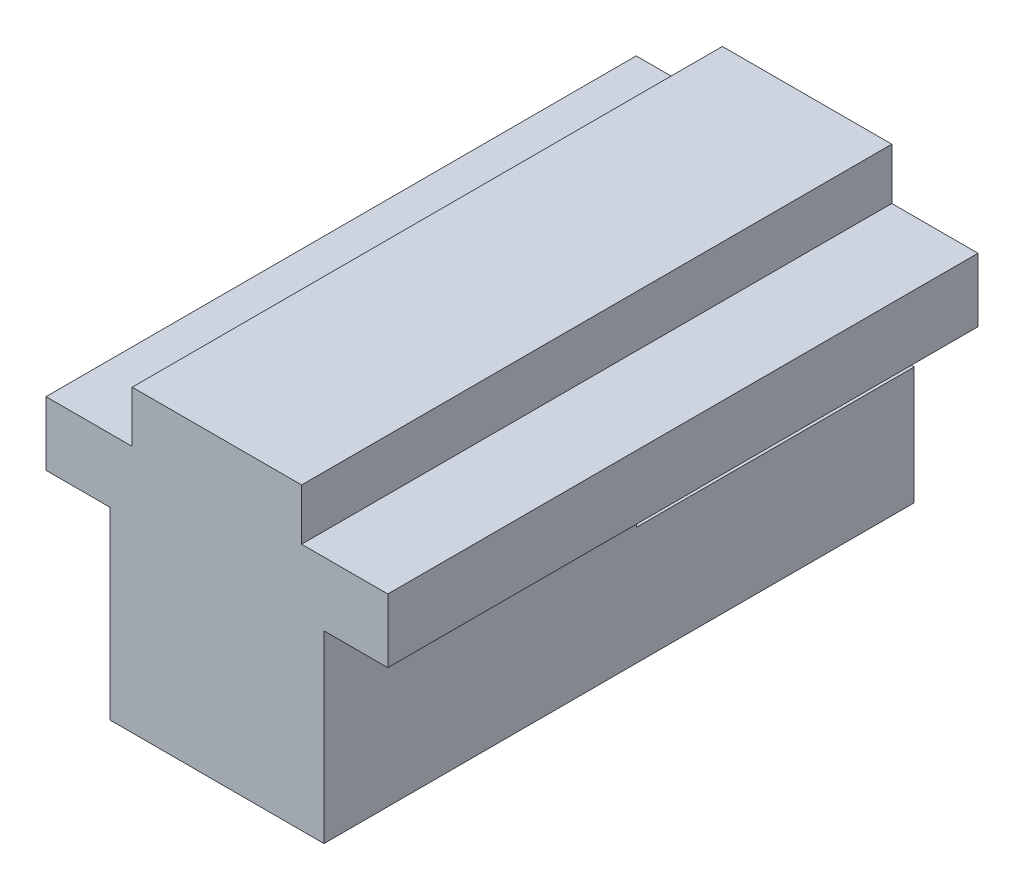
ISO-10303-21;
HEADER;
FILE_DESCRIPTION(('STEP AP214'),'2;1');
FILE_NAME('part.step','',(''),(''),'','','');
FILE_SCHEMA(('AUTOMOTIVE_DESIGN { 1 0 10303 214 1 1 1 1 }'));
ENDSEC;
DATA;
#1=APPLICATION_CONTEXT('core data for automotive mechanical design processes');
#2=APPLICATION_PROTOCOL_DEFINITION('international standard','automotive_design',2000,#1);
#3=PRODUCT_CONTEXT('',#1,'mechanical');
#4=PRODUCT('Part','Part','',(#3));
#5=PRODUCT_RELATED_PRODUCT_CATEGORY('part','',(#4));
#6=PRODUCT_DEFINITION_FORMATION('','',#4);
#7=PRODUCT_DEFINITION_CONTEXT('part definition',#1,'design');
#8=PRODUCT_DEFINITION('design','',#6,#7);
#9=PRODUCT_DEFINITION_SHAPE('','',#8);
#10=(LENGTH_UNIT() NAMED_UNIT(*) SI_UNIT(.MILLI.,.METRE.));
#11=(NAMED_UNIT(*) PLANE_ANGLE_UNIT() SI_UNIT($,.RADIAN.));
#12=(NAMED_UNIT(*) SI_UNIT($,.STERADIAN.) SOLID_ANGLE_UNIT());
#13=UNCERTAINTY_MEASURE_WITH_UNIT(LENGTH_MEASURE(1.E-05),#10,'distance_accuracy_value','');
#14=(GEOMETRIC_REPRESENTATION_CONTEXT(3) GLOBAL_UNCERTAINTY_ASSIGNED_CONTEXT((#13)) GLOBAL_UNIT_ASSIGNED_CONTEXT((#10,
#11,#12)) REPRESENTATION_CONTEXT('',''));
#15=CARTESIAN_POINT('',(0.,0.,0.));
#16=DIRECTION('',(0.,0.,1.));
#17=DIRECTION('',(1.,0.,0.));
#18=AXIS2_PLACEMENT_3D('',#15,#16,#17);
#19=CARTESIAN_POINT('',(0.,0.,-43.815));
#20=DIRECTION('',(0.,0.,-1.));
#21=DIRECTION('',(-1.,0.,0.));
#22=AXIS2_PLACEMENT_3D('',#19,#20,#21);
#23=PLANE('',#22);
#24=DIRECTION('',(-1.,0.,0.));
#25=VECTOR('',#24,1.);
#26=CARTESIAN_POINT('',(25.3746,0.0127000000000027,-43.815));
#27=LINE('',#26,#25);
#28=CARTESIAN_POINT('',(25.3746,0.0127000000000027,-43.815));
#29=VERTEX_POINT('',#28);
#30=CARTESIAN_POINT('',(0.,0.0126999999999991,-43.815));
#31=VERTEX_POINT('',#30);
#32=EDGE_CURVE('E261',#29,#31,#27,.T.);
#33=ORIENTED_EDGE('',*,*,#32,.T.);
#34=DIRECTION('',(0.,-1.,0.));
#35=VECTOR('',#34,1.);
#36=CARTESIAN_POINT('',(0.,0.,-43.815));
#37=LINE('',#36,#35);
#38=CARTESIAN_POINT('',(0.,4.7371,-43.815));
#39=VERTEX_POINT('',#38);
#40=EDGE_CURVE('E215',#39,#31,#37,.T.);
#41=ORIENTED_EDGE('',*,*,#40,.F.);
#42=DIRECTION('',(-1.,0.,0.));
#43=VECTOR('',#42,1.);
#44=CARTESIAN_POINT('',(0.,4.7371,-43.815));
#45=LINE('',#44,#43);
#46=CARTESIAN_POINT('',(6.4008,4.7371,-43.815));
#47=VERTEX_POINT('',#46);
#48=EDGE_CURVE('E160',#47,#39,#45,.T.);
#49=ORIENTED_EDGE('',*,*,#48,.F.);
#50=DIRECTION('',(0.,-1.,0.));
#51=VECTOR('',#50,1.);
#52=CARTESIAN_POINT('',(6.4008,4.7371,-43.815));
#53=LINE('',#52,#51);
#54=CARTESIAN_POINT('',(6.4008,8.5471,-43.815));
#55=VERTEX_POINT('',#54);
#56=EDGE_CURVE('E146',#55,#47,#53,.T.);
#57=ORIENTED_EDGE('',*,*,#56,.F.);
#58=DIRECTION('',(-1.,0.,0.));
#59=VECTOR('',#58,1.);
#60=CARTESIAN_POINT('',(15.9258,8.5471,-43.815));
#61=LINE('',#60,#59);
#62=CARTESIAN_POINT('',(18.9738,8.5471,-43.815));
#63=VERTEX_POINT('',#62);
#64=EDGE_CURVE('E134',#63,#55,#61,.T.);
#65=ORIENTED_EDGE('',*,*,#64,.F.);
#66=DIRECTION('',(0.,1.,0.));
#67=VECTOR('',#66,1.);
#68=CARTESIAN_POINT('',(18.9738,4.7371,-43.815));
#69=LINE('',#68,#67);
#70=CARTESIAN_POINT('',(18.9738,4.7371,-43.815));
#71=VERTEX_POINT('',#70);
#72=EDGE_CURVE('E147',#71,#63,#69,.T.);
#73=ORIENTED_EDGE('',*,*,#72,.F.);
#74=DIRECTION('',(-1.,0.,0.));
#75=VECTOR('',#74,1.);
#76=CARTESIAN_POINT('',(18.9738,4.7371,-43.815));
#77=LINE('',#76,#75);
#78=CARTESIAN_POINT('',(25.3746,4.7371,-43.815));
#79=VERTEX_POINT('',#78);
#80=EDGE_CURVE('E281',#79,#71,#77,.T.);
#81=ORIENTED_EDGE('',*,*,#80,.F.);
#82=DIRECTION('',(0.,1.,0.));
#83=VECTOR('',#82,1.);
#84=CARTESIAN_POINT('',(25.3746,0.,-43.815));
#85=LINE('',#84,#83);
#86=EDGE_CURVE('E278',#29,#79,#85,.T.);
#87=ORIENTED_EDGE('',*,*,#86,.F.);
#88=EDGE_LOOP('',(#33,#41,#49,#57,#65,#73,#81,#87));
#89=FACE_BOUND('',#88,.T.);
#90=ADVANCED_FACE('F40',(#89),#23,.T.);
#91=CARTESIAN_POINT('',(0.,0.,-43.815));
#92=DIRECTION('',(-1.,0.,0.));
#93=DIRECTION('',(0.,0.,1.));
#94=AXIS2_PLACEMENT_3D('',#91,#92,#93);
#95=PLANE('',#94);
#96=DIRECTION('',(0.,0.,-1.));
#97=VECTOR('',#96,1.);
#98=CARTESIAN_POINT('',(0.,0.0126999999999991,-43.815));
#99=LINE('',#98,#97);
#100=CARTESIAN_POINT('',(0.,0.0126999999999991,-23.1902));
#101=VERTEX_POINT('',#100);
#102=EDGE_CURVE('E391',#101,#31,#99,.T.);
#103=ORIENTED_EDGE('',*,*,#102,.F.);
#104=DIRECTION('',(0.,1.,0.));
#105=VECTOR('',#104,1.);
#106=CARTESIAN_POINT('',(0.,0.0126999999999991,-23.1902));
#107=LINE('',#106,#105);
#108=CARTESIAN_POINT('',(0.,0.,-23.1902));
#109=VERTEX_POINT('',#108);
#110=EDGE_CURVE('E388',#109,#101,#107,.T.);
#111=ORIENTED_EDGE('',*,*,#110,.F.);
#112=DIRECTION('',(0.,0.,1.));
#113=VECTOR('',#112,1.);
#114=CARTESIAN_POINT('',(0.,0.,-43.815));
#115=LINE('',#114,#113);
#116=CARTESIAN_POINT('',(0.,0.,0.));
#117=VERTEX_POINT('',#116);
#118=EDGE_CURVE('E166',#109,#117,#115,.T.);
#119=ORIENTED_EDGE('',*,*,#118,.T.);
#120=DIRECTION('',(0.,-1.,0.));
#121=VECTOR('',#120,1.);
#122=CARTESIAN_POINT('',(0.,0.,0.));
#123=LINE('',#122,#121);
#124=CARTESIAN_POINT('',(0.,4.7371,0.));
#125=VERTEX_POINT('',#124);
#126=EDGE_CURVE('E170',#125,#117,#123,.T.);
#127=ORIENTED_EDGE('',*,*,#126,.F.);
#128=DIRECTION('',(0.,0.,1.));
#129=VECTOR('',#128,1.);
#130=CARTESIAN_POINT('',(0.,4.7371,-43.815));
#131=LINE('',#130,#129);
#132=EDGE_CURVE('E65',#39,#125,#131,.T.);
#133=ORIENTED_EDGE('',*,*,#132,.F.);
#134=ORIENTED_EDGE('',*,*,#40,.T.);
#135=EDGE_LOOP('',(#103,#111,#119,#127,#133,#134));
#136=FACE_BOUND('',#135,.T.);
#137=ADVANCED_FACE('F42',(#136),#95,.T.);
#138=CARTESIAN_POINT('',(0.,4.7371,-43.815));
#139=DIRECTION('',(0.,1.,0.));
#140=DIRECTION('',(0.,0.,1.));
#141=AXIS2_PLACEMENT_3D('',#138,#139,#140);
#142=PLANE('',#141);
#143=DIRECTION('',(-1.,0.,0.));
#144=VECTOR('',#143,1.);
#145=CARTESIAN_POINT('',(0.,4.7371,0.));
#146=LINE('',#145,#144);
#147=CARTESIAN_POINT('',(6.4008,4.7371,0.));
#148=VERTEX_POINT('',#147);
#149=EDGE_CURVE('E211',#148,#125,#146,.T.);
#150=ORIENTED_EDGE('',*,*,#149,.F.);
#151=DIRECTION('',(0.,0.,1.));
#152=VECTOR('',#151,1.);
#153=CARTESIAN_POINT('',(6.4008,4.7371,-43.815));
#154=LINE('',#153,#152);
#155=EDGE_CURVE('E157',#47,#148,#154,.T.);
#156=ORIENTED_EDGE('',*,*,#155,.F.);
#157=ORIENTED_EDGE('',*,*,#48,.T.);
#158=ORIENTED_EDGE('',*,*,#132,.T.);
#159=EDGE_LOOP('',(#150,#156,#157,#158));
#160=FACE_BOUND('',#159,.T.);
#161=ADVANCED_FACE('F458',(#160),#142,.T.);
#162=CARTESIAN_POINT('',(6.4008,4.7371,-43.815));
#163=DIRECTION('',(-1.,0.,0.));
#164=DIRECTION('',(0.,0.,1.));
#165=AXIS2_PLACEMENT_3D('',#162,#163,#164);
#166=PLANE('',#165);
#167=DIRECTION('',(0.,-1.,0.));
#168=VECTOR('',#167,1.);
#169=CARTESIAN_POINT('',(6.4008,4.7371,0.));
#170=LINE('',#169,#168);
#171=CARTESIAN_POINT('',(6.4008,8.5471,0.));
#172=VERTEX_POINT('',#171);
#173=EDGE_CURVE('E154',#172,#148,#170,.T.);
#174=ORIENTED_EDGE('',*,*,#173,.F.);
#175=DIRECTION('',(0.,0.,1.));
#176=VECTOR('',#175,1.);
#177=CARTESIAN_POINT('',(6.4008,8.5471,-43.815));
#178=LINE('',#177,#176);
#179=EDGE_CURVE('E137',#55,#172,#178,.T.);
#180=ORIENTED_EDGE('',*,*,#179,.F.);
#181=ORIENTED_EDGE('',*,*,#56,.T.);
#182=ORIENTED_EDGE('',*,*,#155,.T.);
#183=EDGE_LOOP('',(#174,#180,#181,#182));
#184=FACE_BOUND('',#183,.T.);
#185=ADVANCED_FACE('F151',(#184),#166,.T.);
#186=CARTESIAN_POINT('',(6.4008,8.5471,-43.815));
#187=DIRECTION('',(0.,1.,0.));
#188=DIRECTION('',(0.,0.,1.));
#189=AXIS2_PLACEMENT_3D('',#186,#187,#188);
#190=PLANE('',#189);
#191=DIRECTION('',(-1.,0.,0.));
#192=VECTOR('',#191,1.);
#193=CARTESIAN_POINT('',(6.4008,8.5471,0.));
#194=LINE('',#193,#192);
#195=CARTESIAN_POINT('',(18.9738,8.5471,0.));
#196=VERTEX_POINT('',#195);
#197=EDGE_CURVE('E206',#196,#172,#194,.T.);
#198=ORIENTED_EDGE('',*,*,#197,.F.);
#199=DIRECTION('',(0.,0.,1.));
#200=VECTOR('',#199,1.);
#201=CARTESIAN_POINT('',(18.9738,8.5471,-43.815));
#202=LINE('',#201,#200);
#203=EDGE_CURVE('E140',#63,#196,#202,.T.);
#204=ORIENTED_EDGE('',*,*,#203,.F.);
#205=ORIENTED_EDGE('',*,*,#64,.T.);
#206=ORIENTED_EDGE('',*,*,#179,.T.);
#207=EDGE_LOOP('',(#198,#204,#205,#206));
#208=FACE_BOUND('',#207,.T.);
#209=ADVANCED_FACE('F136',(#208),#190,.T.);
#210=CARTESIAN_POINT('',(18.9738,4.7371,-43.815));
#211=DIRECTION('',(1.,0.,0.));
#212=DIRECTION('',(0.,0.,-1.));
#213=AXIS2_PLACEMENT_3D('',#210,#211,#212);
#214=PLANE('',#213);
#215=DIRECTION('',(0.,1.,0.));
#216=VECTOR('',#215,1.);
#217=CARTESIAN_POINT('',(18.9738,4.7371,0.));
#218=LINE('',#217,#216);
#219=CARTESIAN_POINT('',(18.9738,4.7371,0.));
#220=VERTEX_POINT('',#219);
#221=EDGE_CURVE('E202',#220,#196,#218,.T.);
#222=ORIENTED_EDGE('',*,*,#221,.F.);
#223=DIRECTION('',(0.,0.,1.));
#224=VECTOR('',#223,1.);
#225=CARTESIAN_POINT('',(18.9738,4.7371,-43.815));
#226=LINE('',#225,#224);
#227=EDGE_CURVE('E222',#71,#220,#226,.T.);
#228=ORIENTED_EDGE('',*,*,#227,.F.);
#229=ORIENTED_EDGE('',*,*,#72,.T.);
#230=ORIENTED_EDGE('',*,*,#203,.T.);
#231=EDGE_LOOP('',(#222,#228,#229,#230));
#232=FACE_BOUND('',#231,.T.);
#233=ADVANCED_FACE('F288',(#232),#214,.T.);
#234=CARTESIAN_POINT('',(18.9738,4.7371,-43.815));
#235=DIRECTION('',(0.,1.,0.));
#236=DIRECTION('',(0.,0.,1.));
#237=AXIS2_PLACEMENT_3D('',#234,#235,#236);
#238=PLANE('',#237);
#239=DIRECTION('',(-1.,0.,0.));
#240=VECTOR('',#239,1.);
#241=CARTESIAN_POINT('',(18.9738,4.7371,0.));
#242=LINE('',#241,#240);
#243=CARTESIAN_POINT('',(25.3746,4.7371,0.));
#244=VERTEX_POINT('',#243);
#245=EDGE_CURVE('E198',#244,#220,#242,.T.);
#246=ORIENTED_EDGE('',*,*,#245,.F.);
#247=DIRECTION('',(0.,0.,1.));
#248=VECTOR('',#247,1.);
#249=CARTESIAN_POINT('',(25.3746,4.7371,-43.815));
#250=LINE('',#249,#248);
#251=EDGE_CURVE('E225',#79,#244,#250,.T.);
#252=ORIENTED_EDGE('',*,*,#251,.F.);
#253=ORIENTED_EDGE('',*,*,#80,.T.);
#254=ORIENTED_EDGE('',*,*,#227,.T.);
#255=EDGE_LOOP('',(#246,#252,#253,#254));
#256=FACE_BOUND('',#255,.T.);
#257=ADVANCED_FACE('F294',(#256),#238,.T.);
#258=CARTESIAN_POINT('',(25.3746,0.,-43.815));
#259=DIRECTION('',(1.,0.,0.));
#260=DIRECTION('',(0.,0.,-1.));
#261=AXIS2_PLACEMENT_3D('',#258,#259,#260);
#262=PLANE('',#261);
#263=DIRECTION('',(0.,0.,-1.));
#264=VECTOR('',#263,1.);
#265=CARTESIAN_POINT('',(25.3746,0.0127000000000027,-43.815));
#266=LINE('',#265,#264);
#267=CARTESIAN_POINT('',(25.3746,0.0127000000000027,-23.1902));
#268=VERTEX_POINT('',#267);
#269=EDGE_CURVE('E303',#268,#29,#266,.T.);
#270=ORIENTED_EDGE('',*,*,#269,.T.);
#271=ORIENTED_EDGE('',*,*,#86,.T.);
#272=ORIENTED_EDGE('',*,*,#251,.T.);
#273=DIRECTION('',(0.,1.,0.));
#274=VECTOR('',#273,1.);
#275=CARTESIAN_POINT('',(25.3746,0.,0.));
#276=LINE('',#275,#274);
#277=CARTESIAN_POINT('',(25.3746,0.,0.));
#278=VERTEX_POINT('',#277);
#279=EDGE_CURVE('E194',#278,#244,#276,.T.);
#280=ORIENTED_EDGE('',*,*,#279,.F.);
#281=DIRECTION('',(0.,0.,1.));
#282=VECTOR('',#281,1.);
#283=CARTESIAN_POINT('',(25.3746,0.,-43.815));
#284=LINE('',#283,#282);
#285=CARTESIAN_POINT('',(25.3746,0.,-23.1902));
#286=VERTEX_POINT('',#285);
#287=EDGE_CURVE('E228',#286,#278,#284,.T.);
#288=ORIENTED_EDGE('',*,*,#287,.F.);
#289=DIRECTION('',(0.,1.,0.));
#290=VECTOR('',#289,1.);
#291=CARTESIAN_POINT('',(25.3746,0.0127000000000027,-23.1902));
#292=LINE('',#291,#290);
#293=EDGE_CURVE('E397',#286,#268,#292,.T.);
#294=ORIENTED_EDGE('',*,*,#293,.T.);
#295=EDGE_LOOP('',(#270,#271,#272,#280,#288,#294));
#296=FACE_BOUND('',#295,.T.);
#297=ADVANCED_FACE('F298',(#296),#262,.T.);
#298=CARTESIAN_POINT('',(20.6375,0.,-43.815));
#299=DIRECTION('',(0.,-1.,0.));
#300=DIRECTION('',(0.,0.,-1.));
#301=AXIS2_PLACEMENT_3D('',#298,#299,#300);
#302=PLANE('',#301);
#303=DIRECTION('',(-1.,0.,0.));
#304=VECTOR('',#303,1.);
#305=CARTESIAN_POINT('',(20.6375,0.,-23.1902));
#306=LINE('',#305,#304);
#307=CARTESIAN_POINT('',(20.6375,0.,-23.1902));
#308=VERTEX_POINT('',#307);
#309=EDGE_CURVE('E418',#286,#308,#306,.T.);
#310=ORIENTED_EDGE('',*,*,#309,.F.);
#311=ORIENTED_EDGE('',*,*,#287,.T.);
#312=DIRECTION('',(1.,0.,0.));
#313=VECTOR('',#312,1.);
#314=CARTESIAN_POINT('',(20.6375,0.,0.));
#315=LINE('',#314,#313);
#316=CARTESIAN_POINT('',(20.6375,0.,0.));
#317=VERTEX_POINT('',#316);
#318=EDGE_CURVE('E191',#317,#278,#315,.T.);
#319=ORIENTED_EDGE('',*,*,#318,.F.);
#320=DIRECTION('',(0.,0.,1.));
#321=VECTOR('',#320,1.);
#322=CARTESIAN_POINT('',(20.6375,0.,-43.815));
#323=LINE('',#322,#321);
#324=EDGE_CURVE('E230',#308,#317,#323,.T.);
#325=ORIENTED_EDGE('',*,*,#324,.F.);
#326=EDGE_LOOP('',(#310,#311,#319,#325));
#327=FACE_BOUND('',#326,.T.);
#328=ADVANCED_FACE('F473',(#327),#302,.T.);
#329=CARTESIAN_POINT('',(20.6375,0.,-43.815));
#330=DIRECTION('',(1.,0.,0.));
#331=DIRECTION('',(0.,1.,0.));
#332=AXIS2_PLACEMENT_3D('',#329,#330,#331);
#333=PLANE('',#332);
#334=DIRECTION('',(0.,-1.,0.));
#335=VECTOR('',#334,1.);
#336=CARTESIAN_POINT('',(20.6375,0.,-23.1902));
#337=LINE('',#336,#335);
#338=CARTESIAN_POINT('',(20.6375,-4.9403,-23.1902));
#339=VERTEX_POINT('',#338);
#340=EDGE_CURVE('E415',#308,#339,#337,.T.);
#341=ORIENTED_EDGE('',*,*,#340,.F.);
#342=ORIENTED_EDGE('',*,*,#324,.T.);
#343=DIRECTION('',(0.,1.,0.));
#344=VECTOR('',#343,1.);
#345=CARTESIAN_POINT('',(20.6375,0.,0.));
#346=LINE('',#345,#344);
#347=CARTESIAN_POINT('',(20.6375,-13.6779,0.));
#348=VERTEX_POINT('',#347);
#349=EDGE_CURVE('E187',#348,#317,#346,.T.);
#350=ORIENTED_EDGE('',*,*,#349,.F.);
#351=DIRECTION('',(0.,0.,1.));
#352=VECTOR('',#351,1.);
#353=CARTESIAN_POINT('',(20.6375,-13.6779,-43.815));
#354=LINE('',#353,#352);
#355=CARTESIAN_POINT('',(20.6375,-13.6779,-43.815));
#356=VERTEX_POINT('',#355);
#357=EDGE_CURVE('E233',#356,#348,#354,.T.);
#358=ORIENTED_EDGE('',*,*,#357,.F.);
#359=DIRECTION('',(0.,1.,0.));
#360=VECTOR('',#359,1.);
#361=CARTESIAN_POINT('',(20.6375,0.,-43.815));
#362=LINE('',#361,#360);
#363=CARTESIAN_POINT('',(20.6375,-4.9403,-43.815));
#364=VERTEX_POINT('',#363);
#365=EDGE_CURVE('E270',#356,#364,#362,.T.);
#366=ORIENTED_EDGE('',*,*,#365,.T.);
#367=DIRECTION('',(0.,0.,-1.));
#368=VECTOR('',#367,1.);
#369=CARTESIAN_POINT('',(20.6375,-4.9403,-43.815));
#370=LINE('',#369,#368);
#371=EDGE_CURVE('E56',#339,#364,#370,.T.);
#372=ORIENTED_EDGE('',*,*,#371,.F.);
#373=EDGE_LOOP('',(#341,#342,#350,#358,#366,#372));
#374=FACE_BOUND('',#373,.T.);
#375=ADVANCED_FACE('F370',(#374),#333,.T.);
#376=CARTESIAN_POINT('',(4.7625,-13.6779,-43.815));
#377=DIRECTION('',(0.,-1.,0.));
#378=DIRECTION('',(0.,0.,-1.));
#379=AXIS2_PLACEMENT_3D('',#376,#377,#378);
#380=PLANE('',#379);
#381=CARTESIAN_POINT('',(12.8780079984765,-13.6779,-4.1275));
#382=DIRECTION('',(0.,-1.,0.));
#383=DIRECTION('',(0.,0.,-1.));
#384=AXIS2_PLACEMENT_3D('',#381,#382,#383);
#385=CIRCLE('',#384,3.048);
#386=CARTESIAN_POINT('',(12.8780079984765,-13.6779,-7.1755));
#387=VERTEX_POINT('',#386);
#388=EDGE_CURVE('E421',#387,#387,#385,.T.);
#389=ORIENTED_EDGE('',*,*,#388,.F.);
#390=EDGE_LOOP('',(#389));
#391=FACE_BOUND('',#390,.T.);
#392=CARTESIAN_POINT('',(12.8780079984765,-13.6779,-20.0025));
#393=DIRECTION('',(0.,-1.,0.));
#394=DIRECTION('',(0.,0.,-1.));
#395=AXIS2_PLACEMENT_3D('',#392,#393,#394);
#396=CIRCLE('',#395,3.048);
#397=CARTESIAN_POINT('',(12.8780079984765,-13.6779,-23.0505));
#398=VERTEX_POINT('',#397);
#399=EDGE_CURVE('E352',#398,#398,#396,.T.);
#400=ORIENTED_EDGE('',*,*,#399,.F.);
#401=EDGE_LOOP('',(#400));
#402=FACE_BOUND('',#401,.T.);
#403=CARTESIAN_POINT('',(17.4625,-13.6779,-12.065));
#404=DIRECTION('',(0.,-1.,0.));
#405=DIRECTION('',(1.,0.,0.));
#406=AXIS2_PLACEMENT_3D('',#403,#404,#405);
#407=CIRCLE('',#406,1.6002);
#408=CARTESIAN_POINT('',(19.0627,-13.6779,-12.065));
#409=VERTEX_POINT('',#408);
#410=EDGE_CURVE('E342',#409,#409,#407,.T.);
#411=ORIENTED_EDGE('',*,*,#410,.F.);
#412=EDGE_LOOP('',(#411));
#413=FACE_BOUND('',#412,.T.);
#414=CARTESIAN_POINT('',(7.9375,-13.6779,-12.065));
#415=DIRECTION('',(0.,-1.,0.));
#416=DIRECTION('',(1.,0.,0.));
#417=AXIS2_PLACEMENT_3D('',#414,#415,#416);
#418=CIRCLE('',#417,1.6002);
#419=CARTESIAN_POINT('',(9.5377,-13.6779,-12.065));
#420=VERTEX_POINT('',#419);
#421=EDGE_CURVE('E357',#420,#420,#418,.T.);
#422=ORIENTED_EDGE('',*,*,#421,.F.);
#423=EDGE_LOOP('',(#422));
#424=FACE_BOUND('',#423,.T.);
#425=DIRECTION('',(1.,0.,0.));
#426=VECTOR('',#425,1.);
#427=CARTESIAN_POINT('',(4.7625,-13.6779,0.));
#428=LINE('',#427,#426);
#429=CARTESIAN_POINT('',(4.7625,-13.6779,0.));
#430=VERTEX_POINT('',#429);
#431=EDGE_CURVE('E183',#430,#348,#428,.T.);
#432=ORIENTED_EDGE('',*,*,#431,.F.);
#433=DIRECTION('',(0.,0.,1.));
#434=VECTOR('',#433,1.);
#435=CARTESIAN_POINT('',(4.7625,-13.6779,-43.815));
#436=LINE('',#435,#434);
#437=CARTESIAN_POINT('',(4.7625,-13.6779,-43.815));
#438=VERTEX_POINT('',#437);
#439=EDGE_CURVE('E236',#438,#430,#436,.T.);
#440=ORIENTED_EDGE('',*,*,#439,.F.);
#441=DIRECTION('',(1.,0.,0.));
#442=VECTOR('',#441,1.);
#443=CARTESIAN_POINT('',(4.7625,-13.6779,-43.815));
#444=LINE('',#443,#442);
#445=EDGE_CURVE('E266',#438,#356,#444,.T.);
#446=ORIENTED_EDGE('',*,*,#445,.T.);
#447=ORIENTED_EDGE('',*,*,#357,.T.);
#448=EDGE_LOOP('',(#432,#440,#446,#447));
#449=FACE_BOUND('',#448,.T.);
#450=ADVANCED_FACE('F367',(#391,#402,#413,#424,#449),#380,.T.);
#451=CARTESIAN_POINT('',(4.7625,0.,-43.815));
#452=DIRECTION('',(-1.,0.,0.));
#453=DIRECTION('',(0.,-1.,0.));
#454=AXIS2_PLACEMENT_3D('',#451,#452,#453);
#455=PLANE('',#454);
#456=DIRECTION('',(0.,1.,0.));
#457=VECTOR('',#456,1.);
#458=CARTESIAN_POINT('',(4.7625,0.,-23.1902));
#459=LINE('',#458,#457);
#460=CARTESIAN_POINT('',(4.7625,-4.9403,-23.1902));
#461=VERTEX_POINT('',#460);
#462=CARTESIAN_POINT('',(4.7625,0.,-23.1902));
#463=VERTEX_POINT('',#462);
#464=EDGE_CURVE('E259',#461,#463,#459,.T.);
#465=ORIENTED_EDGE('',*,*,#464,.F.);
#466=DIRECTION('',(0.,0.,1.));
#467=VECTOR('',#466,1.);
#468=CARTESIAN_POINT('',(4.7625,-4.9403,-43.815));
#469=LINE('',#468,#467);
#470=CARTESIAN_POINT('',(4.7625,-4.9403,-43.815));
#471=VERTEX_POINT('',#470);
#472=EDGE_CURVE('E248',#471,#461,#469,.T.);
#473=ORIENTED_EDGE('',*,*,#472,.F.);
#474=DIRECTION('',(0.,-1.,0.));
#475=VECTOR('',#474,1.);
#476=CARTESIAN_POINT('',(4.7625,0.,-43.815));
#477=LINE('',#476,#475);
#478=EDGE_CURVE('E116',#471,#438,#477,.T.);
#479=ORIENTED_EDGE('',*,*,#478,.T.);
#480=ORIENTED_EDGE('',*,*,#439,.T.);
#481=DIRECTION('',(0.,-1.,0.));
#482=VECTOR('',#481,1.);
#483=CARTESIAN_POINT('',(4.7625,0.,0.));
#484=LINE('',#483,#482);
#485=CARTESIAN_POINT('',(4.7625,0.,0.));
#486=VERTEX_POINT('',#485);
#487=EDGE_CURVE('E179',#486,#430,#484,.T.);
#488=ORIENTED_EDGE('',*,*,#487,.F.);
#489=DIRECTION('',(0.,0.,1.));
#490=VECTOR('',#489,1.);
#491=CARTESIAN_POINT('',(4.7625,0.,-43.815));
#492=LINE('',#491,#490);
#493=EDGE_CURVE('E239',#463,#486,#492,.T.);
#494=ORIENTED_EDGE('',*,*,#493,.F.);
#495=EDGE_LOOP('',(#465,#473,#479,#480,#488,#494));
#496=FACE_BOUND('',#495,.T.);
#497=ADVANCED_FACE('F256',(#496),#455,.T.);
#498=CARTESIAN_POINT('',(0.,0.,-43.815));
#499=DIRECTION('',(0.,-1.,0.));
#500=DIRECTION('',(0.,0.,-1.));
#501=AXIS2_PLACEMENT_3D('',#498,#499,#500);
#502=PLANE('',#501);
#503=DIRECTION('',(-1.,0.,0.));
#504=VECTOR('',#503,1.);
#505=CARTESIAN_POINT('',(0.,0.,-23.1902));
#506=LINE('',#505,#504);
#507=EDGE_CURVE('E11',#463,#109,#506,.T.);
#508=ORIENTED_EDGE('',*,*,#507,.F.);
#509=ORIENTED_EDGE('',*,*,#493,.T.);
#510=DIRECTION('',(1.,0.,0.));
#511=VECTOR('',#510,1.);
#512=CARTESIAN_POINT('',(0.,0.,0.));
#513=LINE('',#512,#511);
#514=EDGE_CURVE('E174',#117,#486,#513,.T.);
#515=ORIENTED_EDGE('',*,*,#514,.F.);
#516=ORIENTED_EDGE('',*,*,#118,.F.);
#517=EDGE_LOOP('',(#508,#509,#515,#516));
#518=FACE_BOUND('',#517,.T.);
#519=ADVANCED_FACE('F381',(#518),#502,.T.);
#520=DIRECTION('',(-1.,0.,0.));
#521=VECTOR('',#520,1.);
#522=CARTESIAN_POINT('',(0.,-4.9403,-43.815));
#523=LINE('',#522,#521);
#524=EDGE_CURVE('E49',#364,#471,#523,.T.);
#525=ORIENTED_EDGE('',*,*,#524,.F.);
#526=ORIENTED_EDGE('',*,*,#365,.F.);
#527=ORIENTED_EDGE('',*,*,#445,.F.);
#528=ORIENTED_EDGE('',*,*,#478,.F.);
#529=EDGE_LOOP('',(#525,#526,#527,#528));
#530=FACE_BOUND('',#529,.T.);
#531=ADVANCED_FACE('F264',(#530),#23,.T.);
#532=CARTESIAN_POINT('',(0.,0.,0.));
#533=DIRECTION('',(0.,0.,-1.));
#534=DIRECTION('',(-1.,0.,0.));
#535=AXIS2_PLACEMENT_3D('',#532,#533,#534);
#536=PLANE('',#535);
#537=ORIENTED_EDGE('',*,*,#126,.T.);
#538=ORIENTED_EDGE('',*,*,#514,.T.);
#539=ORIENTED_EDGE('',*,*,#487,.T.);
#540=ORIENTED_EDGE('',*,*,#431,.T.);
#541=ORIENTED_EDGE('',*,*,#349,.T.);
#542=ORIENTED_EDGE('',*,*,#318,.T.);
#543=ORIENTED_EDGE('',*,*,#279,.T.);
#544=ORIENTED_EDGE('',*,*,#245,.T.);
#545=ORIENTED_EDGE('',*,*,#221,.T.);
#546=ORIENTED_EDGE('',*,*,#197,.T.);
#547=ORIENTED_EDGE('',*,*,#173,.T.);
#548=ORIENTED_EDGE('',*,*,#149,.T.);
#549=EDGE_LOOP('',(#537,#538,#539,#540,#541,#542,#543,#544,#545,#546,#547,#548));
#550=FACE_BOUND('',#549,.T.);
#551=ADVANCED_FACE('F377',(#550),#536,.F.);
#552=CARTESIAN_POINT('',(7.9375,-7.3279,-12.065));
#553=DIRECTION('',(0.,-1.,0.));
#554=DIRECTION('',(1.,0.,0.));
#555=AXIS2_PLACEMENT_3D('',#552,#553,#554);
#556=CYLINDRICAL_SURFACE('',#555,1.6002);
#557=CARTESIAN_POINT('',(7.9375,-7.3279,-12.065));
#558=DIRECTION('',(0.,-1.,0.));
#559=DIRECTION('',(1.,0.,0.));
#560=AXIS2_PLACEMENT_3D('',#557,#558,#559);
#561=CIRCLE('',#560,1.6002);
#562=CARTESIAN_POINT('',(9.5377,-7.3279,-12.065));
#563=VERTEX_POINT('',#562);
#564=EDGE_CURVE('E175',#563,#563,#561,.T.);
#565=ORIENTED_EDGE('',*,*,#564,.F.);
#566=EDGE_LOOP('',(#565));
#567=FACE_BOUND('',#566,.T.);
#568=ORIENTED_EDGE('',*,*,#421,.T.);
#569=EDGE_LOOP('',(#568));
#570=FACE_BOUND('',#569,.T.);
#571=ADVANCED_FACE('F365',(#567,#570),#556,.F.);
#572=CARTESIAN_POINT('',(7.9375,-7.3279,-12.065));
#573=DIRECTION('',(0.,-1.,0.));
#574=DIRECTION('',(1.,0.,0.));
#575=AXIS2_PLACEMENT_3D('',#572,#573,#574);
#576=PLANE('',#575);
#577=ORIENTED_EDGE('',*,*,#564,.T.);
#578=EDGE_LOOP('',(#577));
#579=FACE_BOUND('',#578,.T.);
#580=ADVANCED_FACE('F441',(#579),#576,.T.);
#581=CARTESIAN_POINT('',(17.4625,-7.3279,-12.065));
#582=DIRECTION('',(0.,-1.,0.));
#583=DIRECTION('',(1.,0.,0.));
#584=AXIS2_PLACEMENT_3D('',#581,#582,#583);
#585=CYLINDRICAL_SURFACE('',#584,1.6002);
#586=CARTESIAN_POINT('',(17.4625,-7.3279,-12.065));
#587=DIRECTION('',(0.,-1.,0.));
#588=DIRECTION('',(1.,0.,0.));
#589=AXIS2_PLACEMENT_3D('',#586,#587,#588);
#590=CIRCLE('',#589,1.6002);
#591=CARTESIAN_POINT('',(19.0627,-7.3279,-12.065));
#592=VERTEX_POINT('',#591);
#593=EDGE_CURVE('E348',#592,#592,#590,.T.);
#594=ORIENTED_EDGE('',*,*,#593,.F.);
#595=EDGE_LOOP('',(#594));
#596=FACE_BOUND('',#595,.T.);
#597=ORIENTED_EDGE('',*,*,#410,.T.);
#598=EDGE_LOOP('',(#597));
#599=FACE_BOUND('',#598,.T.);
#600=ADVANCED_FACE('F439',(#596,#599),#585,.F.);
#601=CARTESIAN_POINT('',(17.4625,-7.3279,-12.065));
#602=DIRECTION('',(0.,-1.,0.));
#603=DIRECTION('',(1.,0.,0.));
#604=AXIS2_PLACEMENT_3D('',#601,#602,#603);
#605=PLANE('',#604);
#606=ORIENTED_EDGE('',*,*,#593,.T.);
#607=EDGE_LOOP('',(#606));
#608=FACE_BOUND('',#607,.T.);
#609=ADVANCED_FACE('F335',(#608),#605,.T.);
#610=CARTESIAN_POINT('',(12.8780079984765,-1.7399,-20.0025));
#611=DIRECTION('',(0.,-1.,0.));
#612=DIRECTION('',(0.,0.,-1.));
#613=AXIS2_PLACEMENT_3D('',#610,#611,#612);
#614=CONICAL_SURFACE('',#613,2.0193,1.02974425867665);
#615=CARTESIAN_POINT('',(12.8780079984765,-0.526582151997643,-20.0025));
#616=VERTEX_POINT('',#615);
#617=VERTEX_LOOP('',#616);
#618=FACE_BOUND('',#617,.T.);
#619=CARTESIAN_POINT('',(12.8780079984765,-1.7399,-20.0025));
#620=DIRECTION('',(0.,-1.,0.));
#621=DIRECTION('',(0.,0.,-1.));
#622=AXIS2_PLACEMENT_3D('',#619,#620,#621);
#623=CIRCLE('',#622,2.0193);
#624=CARTESIAN_POINT('',(12.8780079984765,-1.7399,-22.0218));
#625=VERTEX_POINT('',#624);
#626=EDGE_CURVE('E339',#625,#625,#623,.T.);
#627=ORIENTED_EDGE('',*,*,#626,.T.);
#628=EDGE_LOOP('',(#627));
#629=FACE_BOUND('',#628,.T.);
#630=ADVANCED_FACE('F331',(#618,#629),#614,.F.);
#631=CARTESIAN_POINT('',(12.8780079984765,-13.6779,-20.0025));
#632=DIRECTION('',(0.,-1.,0.));
#633=DIRECTION('',(0.,0.,-1.));
#634=AXIS2_PLACEMENT_3D('',#631,#632,#633);
#635=CYLINDRICAL_SURFACE('',#634,2.0193);
#636=ORIENTED_EDGE('',*,*,#626,.F.);
#637=EDGE_LOOP('',(#636));
#638=FACE_BOUND('',#637,.T.);
#639=CARTESIAN_POINT('',(12.8780079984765,-12.6492,-20.0025));
#640=DIRECTION('',(0.,-1.,0.));
#641=DIRECTION('',(0.,0.,-1.));
#642=AXIS2_PLACEMENT_3D('',#639,#640,#641);
#643=CIRCLE('',#642,2.0193);
#644=CARTESIAN_POINT('',(12.8780079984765,-12.6492,-22.0218));
#645=VERTEX_POINT('',#644);
#646=EDGE_CURVE('E343',#645,#645,#643,.T.);
#647=ORIENTED_EDGE('',*,*,#646,.T.);
#648=EDGE_LOOP('',(#647));
#649=FACE_BOUND('',#648,.T.);
#650=ADVANCED_FACE('F334',(#638,#649),#635,.F.);
#651=CARTESIAN_POINT('',(12.8780079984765,-13.6779,-20.0025));
#652=DIRECTION('',(0.,-1.,0.));
#653=DIRECTION('',(0.,0.,-1.));
#654=AXIS2_PLACEMENT_3D('',#651,#652,#653);
#655=CONICAL_SURFACE('',#654,3.048,0.785398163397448);
#656=ORIENTED_EDGE('',*,*,#646,.F.);
#657=EDGE_LOOP('',(#656));
#658=FACE_BOUND('',#657,.T.);
#659=ORIENTED_EDGE('',*,*,#399,.T.);
#660=EDGE_LOOP('',(#659));
#661=FACE_BOUND('',#660,.T.);
#662=ADVANCED_FACE('F434',(#658,#661),#655,.F.);
#663=CARTESIAN_POINT('',(12.8780079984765,-1.7399,-4.1275));
#664=DIRECTION('',(0.,-1.,0.));
#665=DIRECTION('',(0.,0.,-1.));
#666=AXIS2_PLACEMENT_3D('',#663,#664,#665);
#667=CONICAL_SURFACE('',#666,2.0193,1.02974425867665);
#668=CARTESIAN_POINT('',(12.8780079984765,-0.526582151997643,-4.1275));
#669=VERTEX_POINT('',#668);
#670=VERTEX_LOOP('',#669);
#671=FACE_BOUND('',#670,.T.);
#672=CARTESIAN_POINT('',(12.8780079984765,-1.7399,-4.1275));
#673=DIRECTION('',(0.,-1.,0.));
#674=DIRECTION('',(0.,0.,-1.));
#675=AXIS2_PLACEMENT_3D('',#672,#673,#674);
#676=CIRCLE('',#675,2.0193);
#677=CARTESIAN_POINT('',(12.8780079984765,-1.7399,-6.1468));
#678=VERTEX_POINT('',#677);
#679=EDGE_CURVE('E428',#678,#678,#676,.T.);
#680=ORIENTED_EDGE('',*,*,#679,.T.);
#681=EDGE_LOOP('',(#680));
#682=FACE_BOUND('',#681,.T.);
#683=ADVANCED_FACE('F512',(#671,#682),#667,.F.);
#684=CARTESIAN_POINT('',(12.8780079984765,-13.6779,-4.1275));
#685=DIRECTION('',(0.,-1.,0.));
#686=DIRECTION('',(0.,0.,-1.));
#687=AXIS2_PLACEMENT_3D('',#684,#685,#686);
#688=CYLINDRICAL_SURFACE('',#687,2.0193);
#689=ORIENTED_EDGE('',*,*,#679,.F.);
#690=EDGE_LOOP('',(#689));
#691=FACE_BOUND('',#690,.T.);
#692=CARTESIAN_POINT('',(12.8780079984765,-12.6492,-4.1275));
#693=DIRECTION('',(0.,-1.,0.));
#694=DIRECTION('',(0.,0.,-1.));
#695=AXIS2_PLACEMENT_3D('',#692,#693,#694);
#696=CIRCLE('',#695,2.0193);
#697=CARTESIAN_POINT('',(12.8780079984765,-12.6492,-6.1468));
#698=VERTEX_POINT('',#697);
#699=EDGE_CURVE('E424',#698,#698,#696,.T.);
#700=ORIENTED_EDGE('',*,*,#699,.T.);
#701=EDGE_LOOP('',(#700));
#702=FACE_BOUND('',#701,.T.);
#703=ADVANCED_FACE('F504',(#691,#702),#688,.F.);
#704=CARTESIAN_POINT('',(12.8780079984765,-13.6779,-4.1275));
#705=DIRECTION('',(0.,-1.,0.));
#706=DIRECTION('',(0.,0.,-1.));
#707=AXIS2_PLACEMENT_3D('',#704,#705,#706);
#708=CONICAL_SURFACE('',#707,3.048,0.785398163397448);
#709=ORIENTED_EDGE('',*,*,#699,.F.);
#710=EDGE_LOOP('',(#709));
#711=FACE_BOUND('',#710,.T.);
#712=ORIENTED_EDGE('',*,*,#388,.T.);
#713=EDGE_LOOP('',(#712));
#714=FACE_BOUND('',#713,.T.);
#715=ADVANCED_FACE('F497',(#711,#714),#708,.F.);
#716=CARTESIAN_POINT('',(25.3746,0.0127000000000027,-43.815));
#717=DIRECTION('',(0.,1.,0.));
#718=DIRECTION('',(-1.,0.,0.));
#719=AXIS2_PLACEMENT_3D('',#716,#717,#718);
#720=PLANE('',#719);
#721=ORIENTED_EDGE('',*,*,#32,.F.);
#722=ORIENTED_EDGE('',*,*,#269,.F.);
#723=DIRECTION('',(-1.,0.,0.));
#724=VECTOR('',#723,1.);
#725=CARTESIAN_POINT('',(25.3746,0.0127000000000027,-23.1902));
#726=LINE('',#725,#724);
#727=EDGE_CURVE('E407',#268,#101,#726,.T.);
#728=ORIENTED_EDGE('',*,*,#727,.T.);
#729=ORIENTED_EDGE('',*,*,#102,.T.);
#730=EDGE_LOOP('',(#721,#722,#728,#729));
#731=FACE_BOUND('',#730,.T.);
#732=ADVANCED_FACE('F495',(#731),#720,.F.);
#733=CARTESIAN_POINT('',(25.3746,0.0127000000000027,-23.1902));
#734=DIRECTION('',(0.,0.,1.));
#735=DIRECTION('',(0.,-1.,0.));
#736=AXIS2_PLACEMENT_3D('',#733,#734,#735);
#737=PLANE('',#736);
#738=ORIENTED_EDGE('',*,*,#309,.T.);
#739=ORIENTED_EDGE('',*,*,#340,.T.);
#740=DIRECTION('',(-1.,0.,0.));
#741=VECTOR('',#740,1.);
#742=CARTESIAN_POINT('',(25.3746,-4.9403,-23.1902));
#743=LINE('',#742,#741);
#744=EDGE_CURVE('E404',#339,#461,#743,.T.);
#745=ORIENTED_EDGE('',*,*,#744,.T.);
#746=ORIENTED_EDGE('',*,*,#464,.T.);
#747=ORIENTED_EDGE('',*,*,#507,.T.);
#748=ORIENTED_EDGE('',*,*,#110,.T.);
#749=ORIENTED_EDGE('',*,*,#727,.F.);
#750=ORIENTED_EDGE('',*,*,#293,.F.);
#751=EDGE_LOOP('',(#738,#739,#745,#746,#747,#748,#749,#750));
#752=FACE_BOUND('',#751,.T.);
#753=ADVANCED_FACE('F386',(#752),#737,.F.);
#754=CARTESIAN_POINT('',(25.3746,-4.9403,-43.815));
#755=DIRECTION('',(0.,-1.,0.));
#756=DIRECTION('',(1.,0.,0.));
#757=AXIS2_PLACEMENT_3D('',#754,#755,#756);
#758=PLANE('',#757);
#759=ORIENTED_EDGE('',*,*,#371,.T.);
#760=ORIENTED_EDGE('',*,*,#524,.T.);
#761=ORIENTED_EDGE('',*,*,#472,.T.);
#762=ORIENTED_EDGE('',*,*,#744,.F.);
#763=EDGE_LOOP('',(#759,#760,#761,#762));
#764=FACE_BOUND('',#763,.T.);
#765=ADVANCED_FACE('F246',(#764),#758,.F.);
#766=CLOSED_SHELL('',(#90,#137,#161,#185,#209,#233,#257,#297,#328,#375,#450,#497,#519,#531,#551,
#571,#580,#600,#609,#630,#650,#662,#683,#703,#715,#732,#753,#765));
#767=MANIFOLD_SOLID_BREP('B2',#766);
#768=ADVANCED_BREP_SHAPE_REPRESENTATION('',(#18,#767),#14);
#769=SHAPE_DEFINITION_REPRESENTATION(#9,#768);
ENDSEC;
END-ISO-10303-21;
